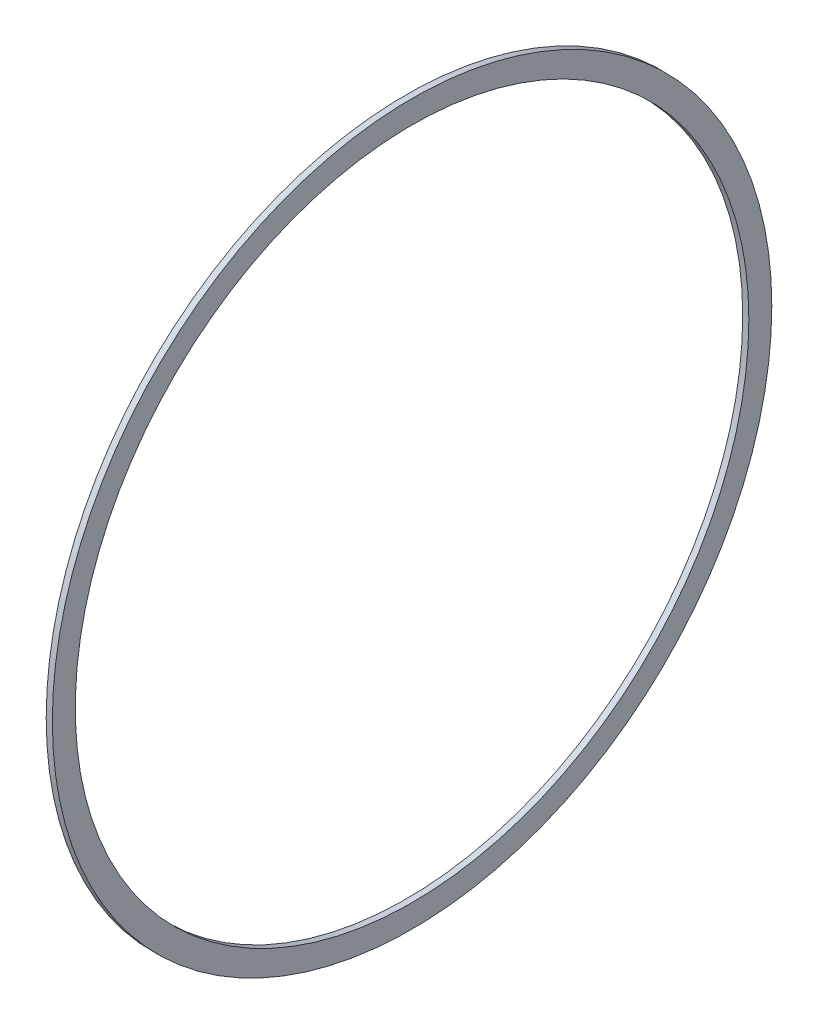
ISO-10303-21;
HEADER;
FILE_DESCRIPTION(('STEP AP214'),'2;1');
FILE_NAME('part.step','',(''),(''),'','','');
FILE_SCHEMA(('AUTOMOTIVE_DESIGN { 1 0 10303 214 1 1 1 1 }'));
ENDSEC;
DATA;
#1=APPLICATION_CONTEXT('core data for automotive mechanical design processes');
#2=APPLICATION_PROTOCOL_DEFINITION('international standard','automotive_design',2000,#1);
#3=PRODUCT_CONTEXT('',#1,'mechanical');
#4=PRODUCT('Part','Part','',(#3));
#5=PRODUCT_RELATED_PRODUCT_CATEGORY('part','',(#4));
#6=PRODUCT_DEFINITION_FORMATION('','',#4);
#7=PRODUCT_DEFINITION_CONTEXT('part definition',#1,'design');
#8=PRODUCT_DEFINITION('design','',#6,#7);
#9=PRODUCT_DEFINITION_SHAPE('','',#8);
#10=(LENGTH_UNIT() NAMED_UNIT(*) SI_UNIT(.MILLI.,.METRE.));
#11=(NAMED_UNIT(*) PLANE_ANGLE_UNIT() SI_UNIT($,.RADIAN.));
#12=(NAMED_UNIT(*) SI_UNIT($,.STERADIAN.) SOLID_ANGLE_UNIT());
#13=UNCERTAINTY_MEASURE_WITH_UNIT(LENGTH_MEASURE(1.E-05),#10,'distance_accuracy_value','');
#14=(GEOMETRIC_REPRESENTATION_CONTEXT(3) GLOBAL_UNCERTAINTY_ASSIGNED_CONTEXT((#13)) GLOBAL_UNIT_ASSIGNED_CONTEXT((#10,
#11,#12)) REPRESENTATION_CONTEXT('',''));
#15=CARTESIAN_POINT('',(0.,0.,0.));
#16=DIRECTION('',(0.,0.,1.));
#17=DIRECTION('',(1.,0.,0.));
#18=AXIS2_PLACEMENT_3D('',#15,#16,#17);
#19=CARTESIAN_POINT('',(0.,0.,0.));
#20=DIRECTION('',(1.,0.,0.));
#21=DIRECTION('',(0.,0.,-1.));
#22=AXIS2_PLACEMENT_3D('',#19,#20,#21);
#23=PLANE('',#22);
#24=CARTESIAN_POINT('',(0.,0.,0.));
#25=DIRECTION('',(1.,0.,0.));
#26=DIRECTION('',(0.,0.,-1.));
#27=AXIS2_PLACEMENT_3D('',#24,#25,#26);
#28=CIRCLE('',#27,110.);
#29=CARTESIAN_POINT('',(0.,0.,-110.));
#30=VERTEX_POINT('',#29);
#31=EDGE_CURVE('E42',#30,#30,#28,.T.);
#32=ORIENTED_EDGE('',*,*,#31,.T.);
#33=EDGE_LOOP('',(#32));
#34=FACE_BOUND('',#33,.T.);
#35=CARTESIAN_POINT('',(0.,0.,0.));
#36=DIRECTION('',(-1.,0.,0.));
#37=DIRECTION('',(0.,0.,1.));
#38=AXIS2_PLACEMENT_3D('',#35,#36,#37);
#39=CIRCLE('',#38,117.5);
#40=CARTESIAN_POINT('',(0.,0.,117.5));
#41=VERTEX_POINT('',#40);
#42=EDGE_CURVE('E10',#41,#41,#39,.T.);
#43=ORIENTED_EDGE('',*,*,#42,.T.);
#44=EDGE_LOOP('',(#43));
#45=FACE_BOUND('',#44,.T.);
#46=ADVANCED_FACE('F32',(#34,#45),#23,.F.);
#47=CARTESIAN_POINT('',(0.,0.,0.));
#48=DIRECTION('',(-1.,0.,0.));
#49=DIRECTION('',(0.,0.,1.));
#50=AXIS2_PLACEMENT_3D('',#47,#48,#49);
#51=CYLINDRICAL_SURFACE('',#50,117.5);
#52=ORIENTED_EDGE('',*,*,#42,.F.);
#53=EDGE_LOOP('',(#52));
#54=FACE_BOUND('',#53,.T.);
#55=CARTESIAN_POINT('',(2.,0.,0.));
#56=DIRECTION('',(-1.,0.,0.));
#57=DIRECTION('',(0.,0.,1.));
#58=AXIS2_PLACEMENT_3D('',#55,#56,#57);
#59=CIRCLE('',#58,117.5);
#60=CARTESIAN_POINT('',(2.,0.,117.5));
#61=VERTEX_POINT('',#60);
#62=EDGE_CURVE('E38',#61,#61,#59,.T.);
#63=ORIENTED_EDGE('',*,*,#62,.T.);
#64=EDGE_LOOP('',(#63));
#65=FACE_BOUND('',#64,.T.);
#66=ADVANCED_FACE('F57',(#54,#65),#51,.T.);
#67=CARTESIAN_POINT('',(2.00000000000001,117.5,0.));
#68=DIRECTION('',(-1.,0.,0.));
#69=DIRECTION('',(0.,0.,1.));
#70=AXIS2_PLACEMENT_3D('',#67,#68,#69);
#71=PLANE('',#70);
#72=CARTESIAN_POINT('',(2.00000000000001,0.,0.));
#73=DIRECTION('',(1.,0.,0.));
#74=DIRECTION('',(0.,0.,-1.));
#75=AXIS2_PLACEMENT_3D('',#72,#73,#74);
#76=CIRCLE('',#75,110.);
#77=CARTESIAN_POINT('',(2.00000000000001,0.,-110.));
#78=VERTEX_POINT('',#77);
#79=EDGE_CURVE('E46',#78,#78,#76,.T.);
#80=ORIENTED_EDGE('',*,*,#79,.F.);
#81=EDGE_LOOP('',(#80));
#82=FACE_BOUND('',#81,.T.);
#83=ORIENTED_EDGE('',*,*,#62,.F.);
#84=EDGE_LOOP('',(#83));
#85=FACE_BOUND('',#84,.T.);
#86=ADVANCED_FACE('F54',(#82,#85),#71,.F.);
#87=CARTESIAN_POINT('',(0.,0.,0.));
#88=DIRECTION('',(1.,0.,0.));
#89=DIRECTION('',(0.,0.,-1.));
#90=AXIS2_PLACEMENT_3D('',#87,#88,#89);
#91=CYLINDRICAL_SURFACE('',#90,110.);
#92=ORIENTED_EDGE('',*,*,#31,.F.);
#93=EDGE_LOOP('',(#92));
#94=FACE_BOUND('',#93,.T.);
#95=ORIENTED_EDGE('',*,*,#79,.T.);
#96=EDGE_LOOP('',(#95));
#97=FACE_BOUND('',#96,.T.);
#98=ADVANCED_FACE('F52',(#94,#97),#91,.F.);
#99=CLOSED_SHELL('',(#46,#66,#86,#98));
#100=MANIFOLD_SOLID_BREP('B2',#99);
#101=ADVANCED_BREP_SHAPE_REPRESENTATION('',(#18,#100),#14);
#102=SHAPE_DEFINITION_REPRESENTATION(#9,#101);
ENDSEC;
END-ISO-10303-21;
